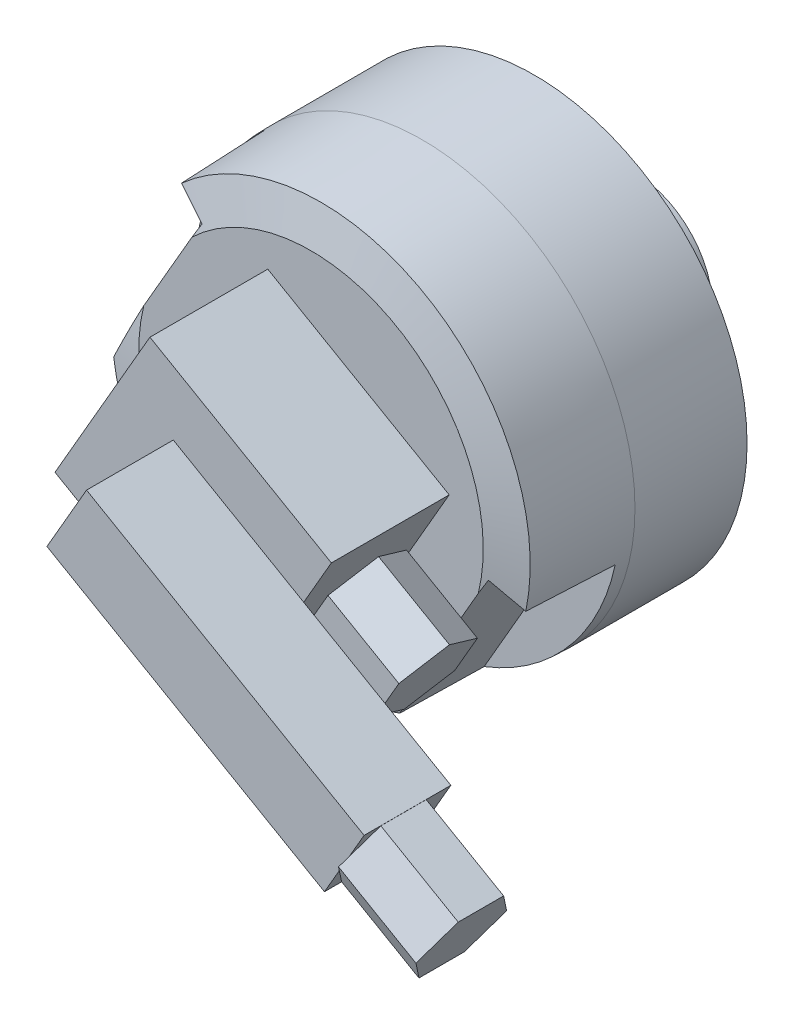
from build123d import *

# Parameters (mm, degrees)
SCHNITT_LINEAR_AUSTRAGEN1_DEPTH = 29.5
AUFSATZ_LINEAR_AUSTRAGEN6_DEPTH = 36
AUFSATZ_LINEAR_AUSTRAGEN7_DEPTH = 26.5
AUFSATZ_LINEAR_AUSTRAGEN8_DEPTH = 27.3
AUFSATZ_LINEAR_AUSTRAGEN9_DEPTH = 25


with BuildPart() as part:
    # Skizze2 → Rotation1 (revolve)
    with BuildSketch(Plane(origin=(0, 0, 0), x_dir=(1, 0, 0), z_dir=(0, 1, 0)), mode=Mode.PRIVATE) as rotation1_sk:
        Polygon((-24, 0), (-65, 0), (-65, -34.24), (-63.919917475, -65.169516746), (-52.61, -68.2), (0, -68.2), (0, 30.5), (-24, 30.5), align=None)
    revolve(rotation1_sk.sketch.rotate(Axis((0, 0, 24.899032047), (0, 0, -1)), 180), axis=Axis((0, 0, 24.899032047), (0, 0, -1)))

    # Skizze10 → Schnitt-Linear austragen1 (cut)
    with BuildSketch(Plane.XY.offset(68.2)):
        Polygon((-33.734282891, 42.570508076), (-83.734282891, -44.032032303), (-101.054790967, -34.032032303), (-51.054790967, 52.570508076), align=None)
        Polygon((53.734282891, -7.929491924), (3.734282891, -94.532032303), (21.054790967, -104.532032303), (71.054790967, -17.929491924), align=None)
    extrude(amount=-SCHNITT_LINEAR_AUSTRAGEN1_DEPTH, mode=Mode.SUBTRACT)

    # Skizze9 → Aufsatz-Linear austragen6 (add)
    with BuildSketch(Plane.XY.offset(68.2)):
        Polygon((-42.212812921, -9.11473671), (13.212812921, -41.11473671), (42.212812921, 9.11473671), (-13.212812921, 41.11473671), align=None)
    extrude(amount=AUFSATZ_LINEAR_AUSTRAGEN6_DEPTH)

    # Skizze11 → Aufsatz-Linear austragen7 (add)
    with BuildSketch(Plane.XY.offset(104.2)):
        Polygon((-6.074355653, 17.478907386), (-18.174355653, -3.478907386), (66.609531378, -52.428907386), (78.709531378, -31.471092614), align=None)
    extrude(amount=AUFSATZ_LINEAR_AUSTRAGEN7_DEPTH)

    # Skizze12 → Aufsatz-Linear austragen8 (add)
    with BuildSketch(Plane(origin=(72.659531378, -41.95, 0), x_dir=(0, 0, -1), z_dir=(0.8660254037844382, -0.5000000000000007, 0))):
        Polygon((-132.456406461, 0), (-125.52820323, -12), (-111.67179677, -12), (-104.743593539, 0), (-111.67179677, 12), (-125.52820323, 12), align=None)
    extrude(amount=AUFSATZ_LINEAR_AUSTRAGEN8_DEPTH)

    # Skizze13 → Aufsatz-Linear austragen9 (add)
    with BuildSketch(Plane(origin=(27.712812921, -16, 0), x_dir=(0, 0, -1), z_dir=(0.8660254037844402, -0.4999999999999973, 0))):
        Polygon((-82.2, 13.856406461), (-94.2, 6.92820323), (-94.2, -6.92820323), (-82.2, -13.856406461), (-70.2, -6.92820323), (-70.2, 6.92820323), align=None)
    extrude(amount=AUFSATZ_LINEAR_AUSTRAGEN9_DEPTH)


solid = part.part
